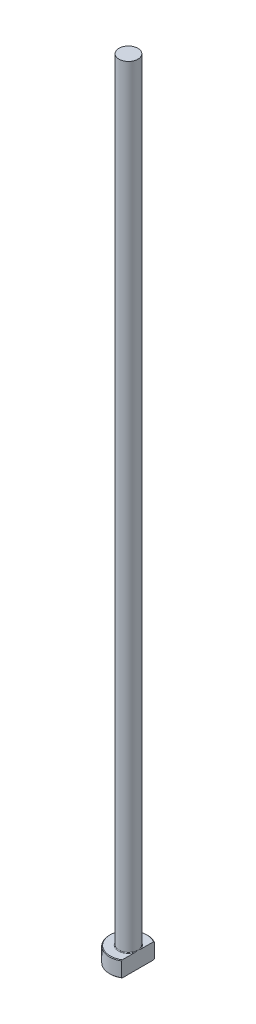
from build123d import *
from build123d.topology import SkipClean

# Parameters (mm, degrees)
CHAMFER1_SIZE = 0.2
FILLET1_R     = 0.2
KEY_DEPTH     = 251.143958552


with BuildPart() as part:
    # Sketch1 → Revolve1 (revolve)
    with BuildSketch(Plane.XY, mode=Mode.PRIVATE) as revolve1_sk:
        Polygon((0, 0), (-6, 0), (-6, 5), (-3, 5), (-3, 250), (0, 250), align=None)
    revolve(revolve1_sk.sketch.rotate(Axis((0, 259.958771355, 0), (0, -1, 0)), 270), axis=Axis((0, 259.958771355, 0), (0, -1, 0)))

    # Chamfer1
    chamfer1_edges = [part.edges().sort_by_distance(p)[0] for p in [
        (0, 5, -6),
        (0, 0, -6),
    ]]
    chamfer(chamfer1_edges, length=CHAMFER1_SIZE)

    # Fillet1
    fillet1_edges = [part.edges().sort_by_distance(p)[0] for p in [
        (0, 5, -3),
    ]]
    fillet(fillet1_edges, radius=FILLET1_R)

    # Sketch2 → KEY (cut, through all)
    with SkipClean():  # the faces are left unmerged after this step: merging them gives an invalid solid
        with BuildSketch(Plane(origin=(0, 0, 0), x_dir=(1, 0, 0), z_dir=(0, 1, 0))):
            with BuildLine():
                Line((3, 5.196152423), (3, -5.196152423))
                ThreePointArc((3, -5.196152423), (6, 0), (3, 5.196152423))
            make_face()
        extrude(amount=KEY_DEPTH, mode=Mode.SUBTRACT)


solid = part.part
